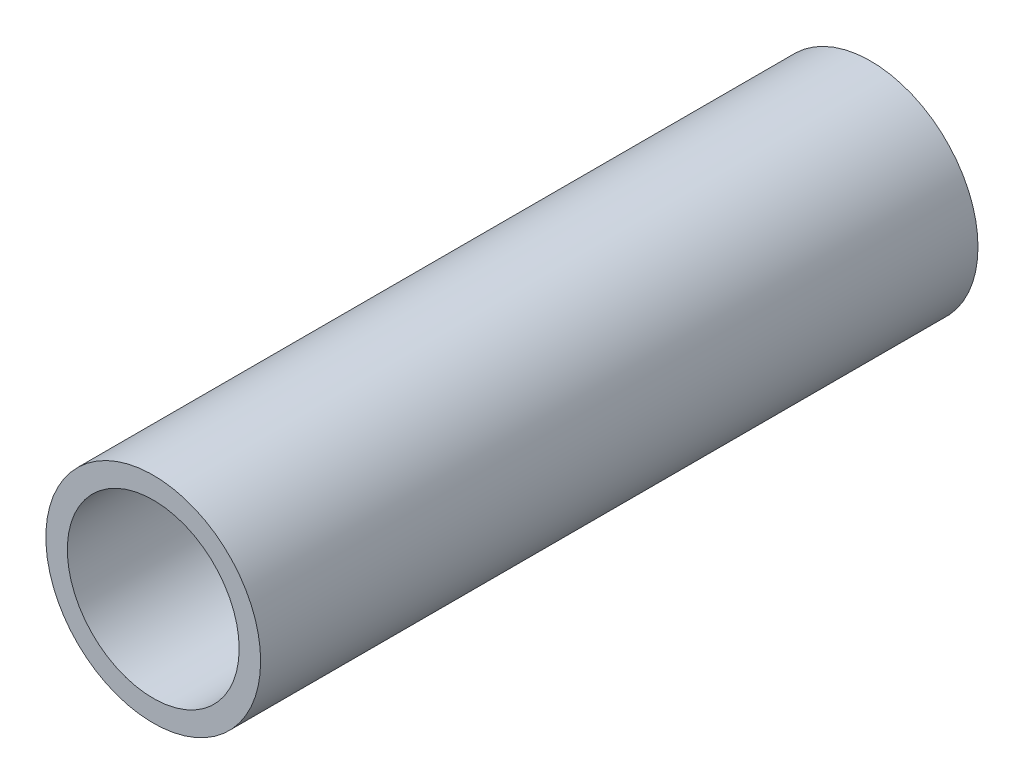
from build123d import *

# Parameters (mm, degrees)
SKETCH1_R           = 25
SKETCH1_R_2         = 20
EXTRUDE_THIN1_DEPTH = 83.5


with BuildPart() as part:
    # Sketch1 → Extrude-Thin1 (new, symmetric)
    with BuildSketch(Plane.XY):
        Circle(SKETCH1_R)
        Circle(SKETCH1_R_2, mode=Mode.SUBTRACT)
    extrude(amount=EXTRUDE_THIN1_DEPTH, both=True)


solid = part.part
